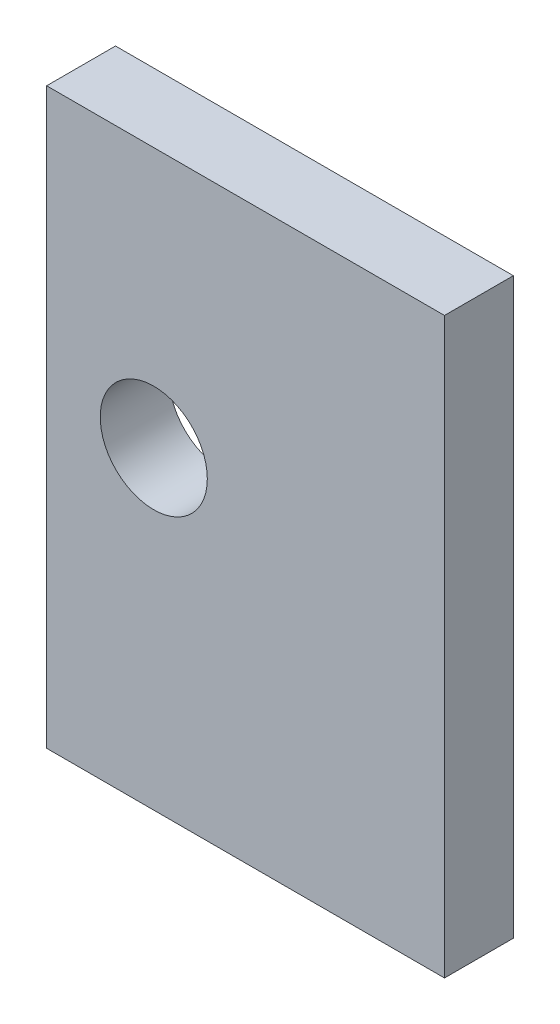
ISO-10303-21;
HEADER;
FILE_DESCRIPTION(('STEP AP214'),'2;1');
FILE_NAME('part.step','',(''),(''),'','','');
FILE_SCHEMA(('AUTOMOTIVE_DESIGN { 1 0 10303 214 1 1 1 1 }'));
ENDSEC;
DATA;
#1=APPLICATION_CONTEXT('core data for automotive mechanical design processes');
#2=APPLICATION_PROTOCOL_DEFINITION('international standard','automotive_design',2000,#1);
#3=PRODUCT_CONTEXT('',#1,'mechanical');
#4=PRODUCT('Part','Part','',(#3));
#5=PRODUCT_RELATED_PRODUCT_CATEGORY('part','',(#4));
#6=PRODUCT_DEFINITION_FORMATION('','',#4);
#7=PRODUCT_DEFINITION_CONTEXT('part definition',#1,'design');
#8=PRODUCT_DEFINITION('design','',#6,#7);
#9=PRODUCT_DEFINITION_SHAPE('','',#8);
#10=(LENGTH_UNIT() NAMED_UNIT(*) SI_UNIT(.MILLI.,.METRE.));
#11=(NAMED_UNIT(*) PLANE_ANGLE_UNIT() SI_UNIT($,.RADIAN.));
#12=(NAMED_UNIT(*) SI_UNIT($,.STERADIAN.) SOLID_ANGLE_UNIT());
#13=UNCERTAINTY_MEASURE_WITH_UNIT(LENGTH_MEASURE(1.E-05),#10,'distance_accuracy_value','');
#14=(GEOMETRIC_REPRESENTATION_CONTEXT(3) GLOBAL_UNCERTAINTY_ASSIGNED_CONTEXT((#13)) GLOBAL_UNIT_ASSIGNED_CONTEXT((#10,
#11,#12)) REPRESENTATION_CONTEXT('',''));
#15=CARTESIAN_POINT('',(0.,0.,0.));
#16=DIRECTION('',(0.,0.,1.));
#17=DIRECTION('',(1.,0.,0.));
#18=AXIS2_PLACEMENT_3D('',#15,#16,#17);
#19=CARTESIAN_POINT('',(26.,-15.,0.));
#20=DIRECTION('',(0.,0.,-1.));
#21=DIRECTION('',(-1.,0.,0.));
#22=AXIS2_PLACEMENT_3D('',#19,#20,#21);
#23=PLANE('',#22);
#24=CARTESIAN_POINT('',(-12.,26.,0.));
#25=DIRECTION('',(0.,0.,1.));
#26=DIRECTION('',(1.,0.,0.));
#27=AXIS2_PLACEMENT_3D('',#24,#25,#26);
#28=CIRCLE('',#27,7.);
#29=CARTESIAN_POINT('',(-5.,26.,0.));
#30=VERTEX_POINT('',#29);
#31=EDGE_CURVE('E413',#30,#30,#28,.T.);
#32=ORIENTED_EDGE('',*,*,#31,.F.);
#33=EDGE_LOOP('',(#32));
#34=FACE_BOUND('',#33,.T.);
#35=DIRECTION('',(0.,-1.,0.));
#36=VECTOR('',#35,1.);
#37=CARTESIAN_POINT('',(-26.,-15.,0.));
#38=LINE('',#37,#36);
#39=CARTESIAN_POINT('',(-26.,60.,0.));
#40=VERTEX_POINT('',#39);
#41=CARTESIAN_POINT('',(-26.,-15.,0.));
#42=VERTEX_POINT('',#41);
#43=EDGE_CURVE('E397',#40,#42,#38,.T.);
#44=ORIENTED_EDGE('',*,*,#43,.T.);
#45=DIRECTION('',(-1.,0.,0.));
#46=VECTOR('',#45,1.);
#47=CARTESIAN_POINT('',(26.,-15.,0.));
#48=LINE('',#47,#46);
#49=CARTESIAN_POINT('',(26.,-15.,0.));
#50=VERTEX_POINT('',#49);
#51=EDGE_CURVE('E11',#50,#42,#48,.T.);
#52=ORIENTED_EDGE('',*,*,#51,.F.);
#53=DIRECTION('',(0.,-1.,0.));
#54=VECTOR('',#53,1.);
#55=CARTESIAN_POINT('',(26.,-15.,0.));
#56=LINE('',#55,#54);
#57=CARTESIAN_POINT('',(26.,60.,0.));
#58=VERTEX_POINT('',#57);
#59=EDGE_CURVE('E420',#58,#50,#56,.T.);
#60=ORIENTED_EDGE('',*,*,#59,.F.);
#61=DIRECTION('',(-1.,0.,0.));
#62=VECTOR('',#61,1.);
#63=CARTESIAN_POINT('',(26.,60.,0.));
#64=LINE('',#63,#62);
#65=EDGE_CURVE('E409',#58,#40,#64,.T.);
#66=ORIENTED_EDGE('',*,*,#65,.T.);
#67=EDGE_LOOP('',(#44,#52,#60,#66));
#68=FACE_BOUND('',#67,.T.);
#69=ADVANCED_FACE('F353',(#34,#68),#23,.F.);
#70=CARTESIAN_POINT('',(26.,-15.,0.));
#71=DIRECTION('',(0.,1.,0.));
#72=DIRECTION('',(0.,0.,1.));
#73=AXIS2_PLACEMENT_3D('',#70,#71,#72);
#74=PLANE('',#73);
#75=DIRECTION('',(0.,0.,-1.));
#76=VECTOR('',#75,1.);
#77=CARTESIAN_POINT('',(-26.,-15.,0.));
#78=LINE('',#77,#76);
#79=CARTESIAN_POINT('',(-26.,-15.,-9.));
#80=VERTEX_POINT('',#79);
#81=EDGE_CURVE('E393',#42,#80,#78,.T.);
#82=ORIENTED_EDGE('',*,*,#81,.T.);
#83=DIRECTION('',(-1.,0.,0.));
#84=VECTOR('',#83,1.);
#85=CARTESIAN_POINT('',(26.,-15.,-9.));
#86=LINE('',#85,#84);
#87=CARTESIAN_POINT('',(26.,-15.,-9.));
#88=VERTEX_POINT('',#87);
#89=EDGE_CURVE('E360',#88,#80,#86,.T.);
#90=ORIENTED_EDGE('',*,*,#89,.F.);
#91=DIRECTION('',(0.,0.,-1.));
#92=VECTOR('',#91,1.);
#93=CARTESIAN_POINT('',(26.,-15.,0.));
#94=LINE('',#93,#92);
#95=EDGE_CURVE('E405',#50,#88,#94,.T.);
#96=ORIENTED_EDGE('',*,*,#95,.F.);
#97=ORIENTED_EDGE('',*,*,#51,.T.);
#98=EDGE_LOOP('',(#82,#90,#96,#97));
#99=FACE_BOUND('',#98,.T.);
#100=ADVANCED_FACE('F404',(#99),#74,.F.);
#101=CARTESIAN_POINT('',(26.,-15.,-9.));
#102=DIRECTION('',(0.,0.,1.));
#103=DIRECTION('',(1.,0.,0.));
#104=AXIS2_PLACEMENT_3D('',#101,#102,#103);
#105=PLANE('',#104);
#106=CARTESIAN_POINT('',(-12.,26.,-9.));
#107=DIRECTION('',(0.,0.,1.));
#108=DIRECTION('',(1.,0.,0.));
#109=AXIS2_PLACEMENT_3D('',#106,#107,#108);
#110=CIRCLE('',#109,7.);
#111=CARTESIAN_POINT('',(-5.,26.,-9.));
#112=VERTEX_POINT('',#111);
#113=EDGE_CURVE('E410',#112,#112,#110,.T.);
#114=ORIENTED_EDGE('',*,*,#113,.T.);
#115=EDGE_LOOP('',(#114));
#116=FACE_BOUND('',#115,.T.);
#117=DIRECTION('',(0.,1.,0.));
#118=VECTOR('',#117,1.);
#119=CARTESIAN_POINT('',(-26.,-15.,-9.));
#120=LINE('',#119,#118);
#121=CARTESIAN_POINT('',(-26.,60.,-9.));
#122=VERTEX_POINT('',#121);
#123=EDGE_CURVE('E398',#80,#122,#120,.T.);
#124=ORIENTED_EDGE('',*,*,#123,.T.);
#125=DIRECTION('',(-1.,0.,0.));
#126=VECTOR('',#125,1.);
#127=CARTESIAN_POINT('',(26.,60.,-9.));
#128=LINE('',#127,#126);
#129=CARTESIAN_POINT('',(26.,60.,-9.));
#130=VERTEX_POINT('',#129);
#131=EDGE_CURVE('E426',#130,#122,#128,.T.);
#132=ORIENTED_EDGE('',*,*,#131,.F.);
#133=DIRECTION('',(0.,1.,0.));
#134=VECTOR('',#133,1.);
#135=CARTESIAN_POINT('',(26.,-15.,-9.));
#136=LINE('',#135,#134);
#137=EDGE_CURVE('E372',#88,#130,#136,.T.);
#138=ORIENTED_EDGE('',*,*,#137,.F.);
#139=ORIENTED_EDGE('',*,*,#89,.T.);
#140=EDGE_LOOP('',(#124,#132,#138,#139));
#141=FACE_BOUND('',#140,.T.);
#142=ADVANCED_FACE('F429',(#116,#141),#105,.F.);
#143=CARTESIAN_POINT('',(26.,60.,0.));
#144=DIRECTION('',(0.,-1.,0.));
#145=DIRECTION('',(0.,0.,-1.));
#146=AXIS2_PLACEMENT_3D('',#143,#144,#145);
#147=PLANE('',#146);
#148=DIRECTION('',(0.,0.,1.));
#149=VECTOR('',#148,1.);
#150=CARTESIAN_POINT('',(-26.,60.,0.));
#151=LINE('',#150,#149);
#152=EDGE_CURVE('E418',#122,#40,#151,.T.);
#153=ORIENTED_EDGE('',*,*,#152,.T.);
#154=ORIENTED_EDGE('',*,*,#65,.F.);
#155=DIRECTION('',(0.,0.,1.));
#156=VECTOR('',#155,1.);
#157=CARTESIAN_POINT('',(26.,60.,0.));
#158=LINE('',#157,#156);
#159=EDGE_CURVE('E367',#130,#58,#158,.T.);
#160=ORIENTED_EDGE('',*,*,#159,.F.);
#161=ORIENTED_EDGE('',*,*,#131,.T.);
#162=EDGE_LOOP('',(#153,#154,#160,#161));
#163=FACE_BOUND('',#162,.T.);
#164=ADVANCED_FACE('F431',(#163),#147,.F.);
#165=CARTESIAN_POINT('',(26.,60.,0.));
#166=DIRECTION('',(-1.,0.,0.));
#167=DIRECTION('',(0.,0.,1.));
#168=AXIS2_PLACEMENT_3D('',#165,#166,#167);
#169=PLANE('',#168);
#170=ORIENTED_EDGE('',*,*,#59,.T.);
#171=ORIENTED_EDGE('',*,*,#95,.T.);
#172=ORIENTED_EDGE('',*,*,#137,.T.);
#173=ORIENTED_EDGE('',*,*,#159,.T.);
#174=EDGE_LOOP('',(#170,#171,#172,#173));
#175=FACE_BOUND('',#174,.T.);
#176=ADVANCED_FACE('F432',(#175),#169,.F.);
#177=CARTESIAN_POINT('',(-26.,60.,0.));
#178=DIRECTION('',(-1.,0.,0.));
#179=DIRECTION('',(0.,0.,1.));
#180=AXIS2_PLACEMENT_3D('',#177,#178,#179);
#181=PLANE('',#180);
#182=ORIENTED_EDGE('',*,*,#43,.F.);
#183=ORIENTED_EDGE('',*,*,#152,.F.);
#184=ORIENTED_EDGE('',*,*,#123,.F.);
#185=ORIENTED_EDGE('',*,*,#81,.F.);
#186=EDGE_LOOP('',(#182,#183,#184,#185));
#187=FACE_BOUND('',#186,.T.);
#188=ADVANCED_FACE('F394',(#187),#181,.T.);
#189=CARTESIAN_POINT('',(-12.,26.,-9.));
#190=DIRECTION('',(0.,0.,1.));
#191=DIRECTION('',(1.,0.,0.));
#192=AXIS2_PLACEMENT_3D('',#189,#190,#191);
#193=CYLINDRICAL_SURFACE('',#192,7.);
#194=ORIENTED_EDGE('',*,*,#113,.F.);
#195=EDGE_LOOP('',(#194));
#196=FACE_BOUND('',#195,.T.);
#197=ORIENTED_EDGE('',*,*,#31,.T.);
#198=EDGE_LOOP('',(#197));
#199=FACE_BOUND('',#198,.T.);
#200=ADVANCED_FACE('F439',(#196,#199),#193,.F.);
#201=CLOSED_SHELL('',(#69,#100,#142,#164,#176,#188,#200));
#202=MANIFOLD_SOLID_BREP('B2',#201);
#203=ADVANCED_BREP_SHAPE_REPRESENTATION('',(#18,#202),#14);
#204=SHAPE_DEFINITION_REPRESENTATION(#9,#203);
ENDSEC;
END-ISO-10303-21;
